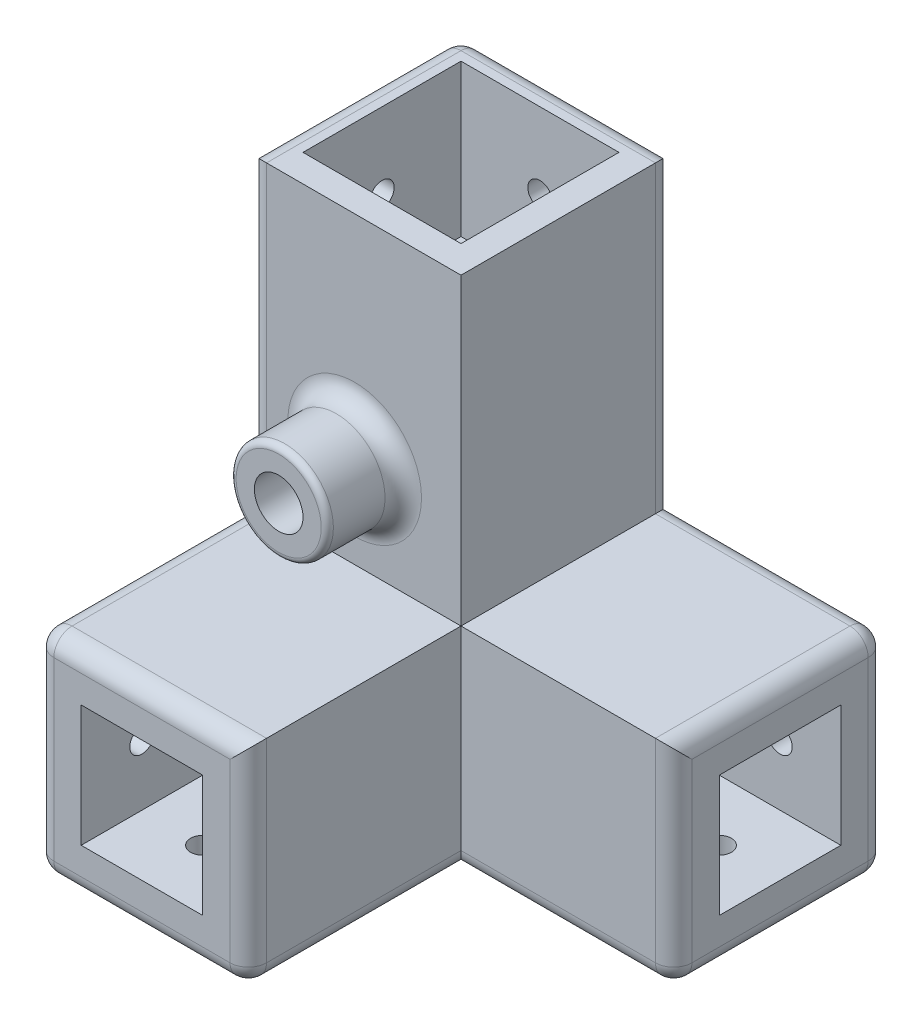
from build123d import *

# Parameters (mm, degrees)
BOSS_EXTRUDE1_DEPTH = 35
SKETCH8_W           = 35
SKETCH8_H           = 35
BOSS_EXTRUDE2_DEPTH = 35
SKETCH9_W           = 20
SKETCH9_H           = 20
CUT_EXTRUDE1_DEPTH  = 20
SKETCH4_W           = 20
SKETCH4_H           = 20
CUT_EXTRUDE2_DEPTH  = 20
SKETCH5_W           = 26
SKETCH5_H           = 26
CUT_EXTRUDE4_DEPTH  = 25
SKETCH12_R          = 2
CUT_EXTRUDE5_DEPTH  = 10
SKETCH13_R          = 2
CUT_EXTRUDE6_DEPTH  = 10
SKETCH14_R          = 2
CUT_EXTRUDE7_DEPTH  = 10
FILLET1_R           = 3
SKETCH15_R          = 8
BOSS_EXTRUDE3_DEPTH = 12.5
SKETCH16_R          = 4
CUT_EXTRUDE8_DEPTH  = 25
FILLET2_R           = 3
FILLET3_R           = 1


with BuildPart() as part:
    # Sketch1 → Boss-Extrude1 (new body)
    with BuildSketch(Plane.XY):
        Polygon((0, 85), (0, 0), (70, 0), (70, 35), (35, 35), (35, 85), align=None)
    extrude(amount=BOSS_EXTRUDE1_DEPTH)

    # Sketch8 → Boss-Extrude2 (add)
    with BuildSketch(Plane.XY.offset(35)):
        with Locations((17.5, 17.5)):
            Rectangle(SKETCH8_W, SKETCH8_H)
    extrude(amount=BOSS_EXTRUDE2_DEPTH)

    # Sketch9 → Cut-Extrude1 (cut)
    with BuildSketch(Plane.XY.offset(70)):
        with Locations((17.5, 17.5)):
            Rectangle(SKETCH9_W, SKETCH9_H)
    extrude(amount=-CUT_EXTRUDE1_DEPTH, mode=Mode.SUBTRACT)

    # Sketch4 → Cut-Extrude2 (cut)
    with BuildSketch(Plane(origin=(70, 0, 0), x_dir=(0, 0, -1), z_dir=(1, 0, 0))):
        with Locations((-17.5, 17.5)):
            Rectangle(SKETCH4_W, SKETCH4_H)
    extrude(amount=-CUT_EXTRUDE2_DEPTH, mode=Mode.SUBTRACT)

    # Sketch5 → Cut-Extrude4 (cut)
    with BuildSketch(Plane(origin=(0, 85, 0), x_dir=(1, 0, 0), z_dir=(0, 1, 0))):
        with Locations((17.5, -17.5)):
            Rectangle(SKETCH5_W, SKETCH5_H)
    extrude(amount=-CUT_EXTRUDE4_DEPTH, mode=Mode.SUBTRACT)

    # Sketch12 → Cut-Extrude5 (cut)
    with BuildSketch(Plane.ZY):
        with Locations(Location((17.5, 72.5, 0), (0, 0, 270))):
            Circle(SKETCH12_R)
        with Locations(Location((60, 17.5, 0), (0, 0, 270))):
            Circle(SKETCH12_R)
    extrude(amount=-CUT_EXTRUDE5_DEPTH, mode=Mode.SUBTRACT)

    # Sketch13 → Cut-Extrude6 (cut)
    with BuildSketch(Plane(origin=(0, 0, 0), x_dir=(-1, 0, 0), z_dir=(0, 0, -1))):
        with Locations((-17.5, 72.5)):
            Circle(SKETCH13_R)
        with Locations((-60, 17.5)):
            Circle(SKETCH13_R)
    extrude(amount=-CUT_EXTRUDE6_DEPTH, mode=Mode.SUBTRACT)

    # Sketch14 → Cut-Extrude7 (cut)
    with BuildSketch(Plane.XZ):
        with Locations(Location((17.5, 60, 0), (0, 0, 270))):
            Circle(SKETCH14_R)
        with Locations(Location((60, 17.5, 0), (0, 0, 270))):
            Circle(SKETCH14_R)
    extrude(amount=-CUT_EXTRUDE7_DEPTH, mode=Mode.SUBTRACT)

    # Fillet1
    fillet1_edges = [part.edges().sort_by_distance(p)[0] for p in [
        (70, 35, 17.5),
        (70, 0, 17.5),
        (0, 0, 35),
        (0, 85, 17.5),
        (70, 17.5, 35),
        (52.5, 0, 35),
        (0, 35, 52.5),
        (35, 0, 52.5),
        (0, 17.5, 70),
        (17.5, 0, 70),
        (35, 17.5, 70),
        (17.5, 35, 70),
        (35, 60, 0),
        (52.5, 35, 0),
        (70, 17.5, 0),
        (35, 0, 0),
        (0, 42.5, 0),
        (17.5, 85, 0),
        (0, 60, 35),
    ]]
    fillet(fillet1_edges, radius=FILLET1_R)

    # Sketch15 → Boss-Extrude3 (add)
    with BuildSketch(Plane.XY.offset(35)):
        with Locations((17.5, 50)):
            Circle(SKETCH15_R)
    extrude(amount=BOSS_EXTRUDE3_DEPTH)

    # Sketch16 → Cut-Extrude8 (cut)
    with BuildSketch(Plane.XY.offset(47.5)):
        with Locations((17.5, 50)):
            Circle(SKETCH16_R)
    extrude(amount=-CUT_EXTRUDE8_DEPTH, mode=Mode.SUBTRACT)

    # Fillet2
    fillet2_edges = [part.edges().sort_by_distance(p)[0] for p in [
        (9.5, 50, 35),
    ]]
    fillet(fillet2_edges, radius=FILLET2_R)

    # Fillet3
    fillet3_edges = [part.edges().sort_by_distance(p)[0] for p in [
        (9.5, 50, 47.5),
    ]]
    fillet(fillet3_edges, radius=FILLET3_R)


solid = part.part
